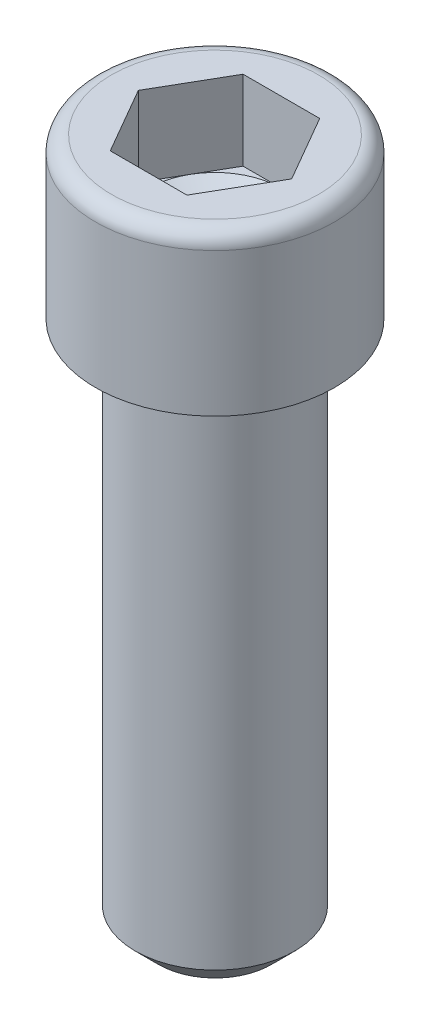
from build123d import *

# Parameters (mm, degrees)
ESQUISSE1_R             = 6
TIGE_DEPTH              = 40
CHANFREIN_D_ENTR_E_SIZE = 1.75
HEXAGONE_DEPTH          = 6


with BuildPart() as part:
    # Esquisse1 → Tige (new body)
    with BuildSketch(Plane(origin=(0, 0, 0), x_dir=(1, 0, 0), z_dir=(0, 1, 0))):
        with Locations(Location((0, 0, 0), (0, 0, 270))):
            Circle(ESQUISSE1_R)
    extrude(amount=-TIGE_DEPTH)

    # Chanfrein d_entr_e
    chanfrein_d_entr_e_edges = [part.edges().sort_by_distance(p)[0] for p in [
        (0, -40, -6),
    ]]
    chamfer(chanfrein_d_entr_e_edges, length=CHANFREIN_D_ENTR_E_SIZE)

    # Esquisse2 → T_te (revolve)
    with BuildSketch(Plane.XY, mode=Mode.PRIVATE) as t_te_sk:
        with BuildLine():
            Line((5, 12), (5, 6))
            Line((5, 6), (0, 3.113248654))
            Line((0, 3.113248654), (0, 0))
            Line((0, 0), (9, 0))
            Line((9, 0), (9, 10.8))
            ThreePointArc((9, 10.8), (8.648528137, 11.648528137), (7.8, 12))
            Line((7.8, 12), (5, 12))
        make_face()
    revolve(t_te_sk.sketch.rotate(Axis((0, 12, 0), (0, -1, 0)), 180), axis=Axis((0, 12, 0), (0, -1, 0)))

    # Esquisse3 → Hexagone (cut)
    with BuildSketch(Plane(origin=(0, 12, -3), x_dir=(1, 0, 0), z_dir=(0, -1, 0))):
        Polygon((2.886751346, 8), (-2.886751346, 8), (-5.773502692, 3), (-2.886751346, -2), (2.886751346, -2), (5.773502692, 3), align=None)
    extrude(amount=HEXAGONE_DEPTH, mode=Mode.SUBTRACT)


solid = part.part
